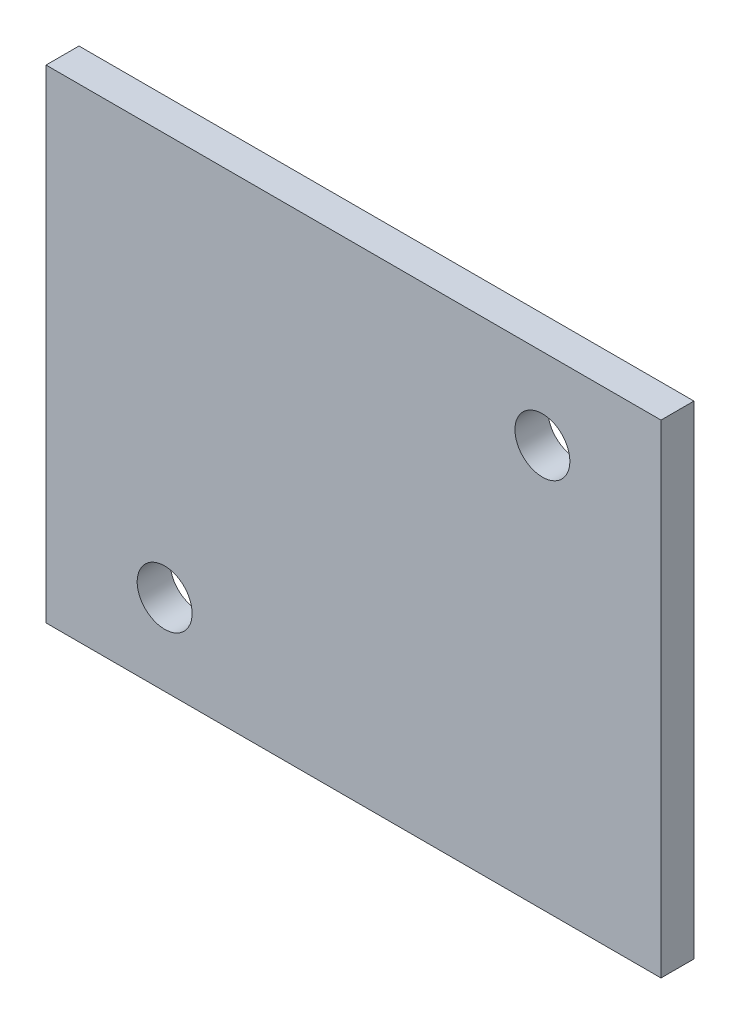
from build123d import *

# Parameters (mm, degrees)
ESQUISSE1_W      = 28
ESQUISSE1_H      = 22
ESQUISSE1_R      = 1.25
EXTRUSION1_DEPTH = 1.5


with BuildPart() as part:
    # Esquisse1 → Extrusion1 (new body)
    with BuildSketch(Plane.XY):
        Rectangle(ESQUISSE1_W, ESQUISSE1_H)
        with Locations((-8.6, -7.3)):
            Circle(ESQUISSE1_R, mode=Mode.SUBTRACT)
        with Locations((8.6, 7.3)):
            Circle(ESQUISSE1_R, mode=Mode.SUBTRACT)
    extrude(amount=EXTRUSION1_DEPTH)


solid = part.part
